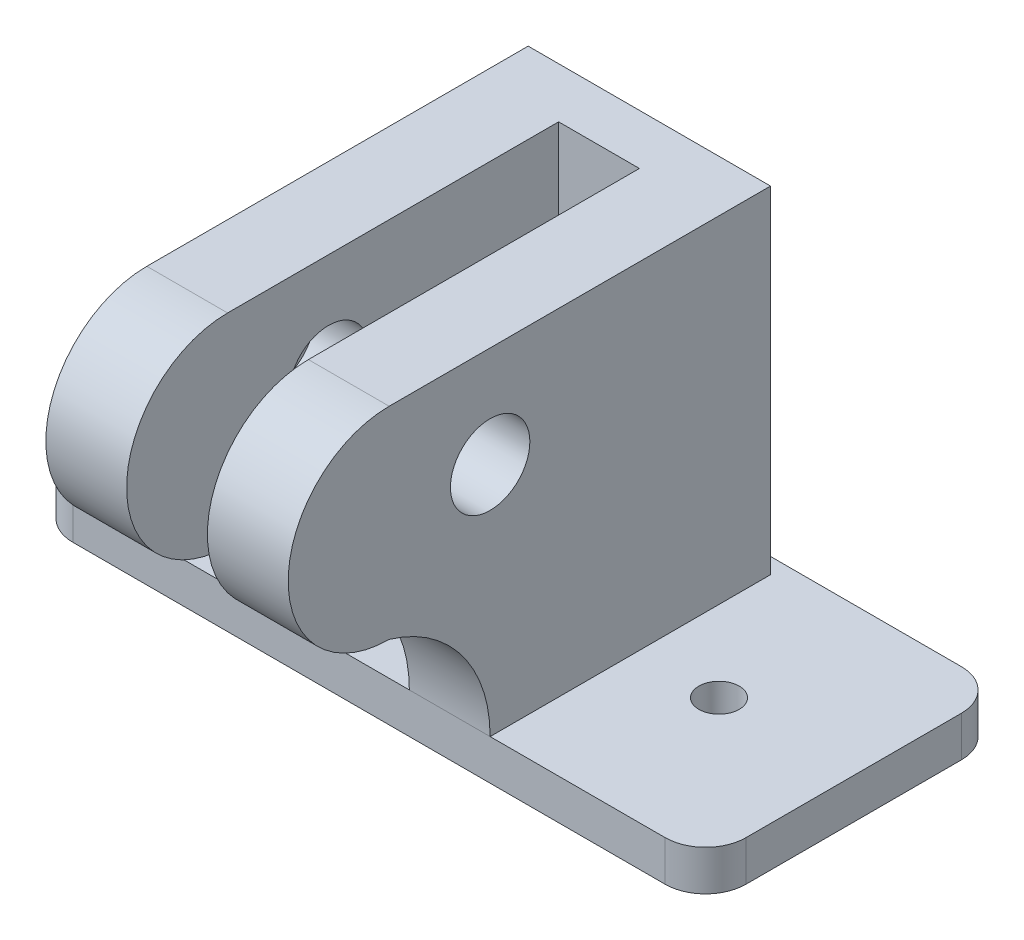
ISO-10303-21;
HEADER;
FILE_DESCRIPTION(('STEP AP214'),'2;1');
FILE_NAME('part.step','',(''),(''),'','','');
FILE_SCHEMA(('AUTOMOTIVE_DESIGN { 1 0 10303 214 1 1 1 1 }'));
ENDSEC;
DATA;
#1=APPLICATION_CONTEXT('core data for automotive mechanical design processes');
#2=APPLICATION_PROTOCOL_DEFINITION('international standard','automotive_design',2000,#1);
#3=PRODUCT_CONTEXT('',#1,'mechanical');
#4=PRODUCT('Part','Part','',(#3));
#5=PRODUCT_RELATED_PRODUCT_CATEGORY('part','',(#4));
#6=PRODUCT_DEFINITION_FORMATION('','',#4);
#7=PRODUCT_DEFINITION_CONTEXT('part definition',#1,'design');
#8=PRODUCT_DEFINITION('design','',#6,#7);
#9=PRODUCT_DEFINITION_SHAPE('','',#8);
#10=(LENGTH_UNIT() NAMED_UNIT(*) SI_UNIT(.MILLI.,.METRE.));
#11=(NAMED_UNIT(*) PLANE_ANGLE_UNIT() SI_UNIT($,.RADIAN.));
#12=(NAMED_UNIT(*) SI_UNIT($,.STERADIAN.) SOLID_ANGLE_UNIT());
#13=UNCERTAINTY_MEASURE_WITH_UNIT(LENGTH_MEASURE(1.E-05),#10,'distance_accuracy_value','');
#14=(GEOMETRIC_REPRESENTATION_CONTEXT(3) GLOBAL_UNCERTAINTY_ASSIGNED_CONTEXT((#13)) GLOBAL_UNIT_ASSIGNED_CONTEXT((#10,
#11,#12)) REPRESENTATION_CONTEXT('',''));
#15=CARTESIAN_POINT('',(0.,0.,0.));
#16=DIRECTION('',(0.,0.,1.));
#17=DIRECTION('',(1.,0.,0.));
#18=AXIS2_PLACEMENT_3D('',#15,#16,#17);
#19=CARTESIAN_POINT('',(-9.,20.5,11.));
#20=DIRECTION('',(1.,0.,0.));
#21=DIRECTION('',(0.,0.,-1.));
#22=AXIS2_PLACEMENT_3D('',#19,#20,#21);
#23=CYLINDRICAL_SURFACE('',#22,1.45);
#24=CARTESIAN_POINT('',(-9.,20.5,11.));
#25=DIRECTION('',(1.,0.,0.));
#26=DIRECTION('',(0.,0.,-1.));
#27=AXIS2_PLACEMENT_3D('',#24,#25,#26);
#28=CIRCLE('',#27,1.45);
#29=CARTESIAN_POINT('',(-9.,20.5,9.55));
#30=VERTEX_POINT('',#29);
#31=EDGE_CURVE('E315',#30,#30,#28,.T.);
#32=ORIENTED_EDGE('',*,*,#31,.F.);
#33=EDGE_LOOP('',(#32));
#34=FACE_BOUND('',#33,.T.);
#35=CARTESIAN_POINT('',(-7.,20.5,11.));
#36=DIRECTION('',(1.,0.,0.));
#37=DIRECTION('',(0.,0.,-1.));
#38=AXIS2_PLACEMENT_3D('',#35,#36,#37);
#39=CIRCLE('',#38,1.45);
#40=CARTESIAN_POINT('',(-7.,20.5,9.55));
#41=VERTEX_POINT('',#40);
#42=EDGE_CURVE('E256',#41,#41,#39,.F.);
#43=ORIENTED_EDGE('',*,*,#42,.F.);
#44=EDGE_LOOP('',(#43));
#45=FACE_BOUND('',#44,.T.);
#46=ADVANCED_FACE('F40',(#34,#45),#23,.F.);
#47=CARTESIAN_POINT('',(3.,28.,9.14820737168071));
#48=DIRECTION('',(1.,0.,0.));
#49=DIRECTION('',(0.,0.,-1.));
#50=AXIS2_PLACEMENT_3D('',#47,#48,#49);
#51=PLANE('',#50);
#52=CARTESIAN_POINT('',(3.,20.5,11.));
#53=DIRECTION('',(1.,0.,0.));
#54=DIRECTION('',(0.,0.,-1.));
#55=AXIS2_PLACEMENT_3D('',#52,#53,#54);
#56=CIRCLE('',#55,2.95);
#57=CARTESIAN_POINT('',(3.,20.5,8.05));
#58=VERTEX_POINT('',#57);
#59=EDGE_CURVE('E263',#58,#58,#56,.T.);
#60=ORIENTED_EDGE('',*,*,#59,.T.);
#61=EDGE_LOOP('',(#60));
#62=FACE_BOUND('',#61,.T.);
#63=CARTESIAN_POINT('',(3.,20.5,18.5));
#64=DIRECTION('',(1.,0.,0.));
#65=DIRECTION('',(0.,0.,-1.));
#66=AXIS2_PLACEMENT_3D('',#63,#64,#65);
#67=CIRCLE('',#66,7.5);
#68=CARTESIAN_POINT('',(3.,28.,18.5));
#69=VERTEX_POINT('',#68);
#70=CARTESIAN_POINT('',(3.,13.,18.5));
#71=VERTEX_POINT('',#70);
#72=EDGE_CURVE('E327',#69,#71,#67,.T.);
#73=ORIENTED_EDGE('',*,*,#72,.F.);
#74=DIRECTION('',(0.,0.,1.));
#75=VECTOR('',#74,1.);
#76=CARTESIAN_POINT('',(3.,28.,-6.08635992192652));
#77=LINE('',#76,#75);
#78=CARTESIAN_POINT('',(3.,28.,-6.08635992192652));
#79=VERTEX_POINT('',#78);
#80=EDGE_CURVE('E339',#79,#69,#77,.T.);
#81=ORIENTED_EDGE('',*,*,#80,.F.);
#82=DIRECTION('',(0.,-1.,0.));
#83=VECTOR('',#82,1.);
#84=CARTESIAN_POINT('',(3.,28.,-6.08635992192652));
#85=LINE('',#84,#83);
#86=CARTESIAN_POINT('',(3.,3.,-6.08635992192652));
#87=VERTEX_POINT('',#86);
#88=EDGE_CURVE('E230',#79,#87,#85,.T.);
#89=ORIENTED_EDGE('',*,*,#88,.T.);
#90=DIRECTION('',(0.,0.,1.));
#91=VECTOR('',#90,1.);
#92=CARTESIAN_POINT('',(3.,3.,9.14820737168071));
#93=LINE('',#92,#91);
#94=CARTESIAN_POINT('',(3.,3.,11.));
#95=VERTEX_POINT('',#94);
#96=EDGE_CURVE('E207',#87,#95,#93,.T.);
#97=ORIENTED_EDGE('',*,*,#96,.T.);
#98=CARTESIAN_POINT('',(3.00000000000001,3.,21.4166666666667));
#99=DIRECTION('',(1.,0.,0.));
#100=DIRECTION('',(0.,0.,-1.));
#101=AXIS2_PLACEMENT_3D('',#98,#99,#100);
#102=CIRCLE('',#101,10.4166666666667);
#103=EDGE_CURVE('E332',#95,#71,#102,.T.);
#104=ORIENTED_EDGE('',*,*,#103,.T.);
#105=EDGE_LOOP('',(#73,#81,#89,#97,#104));
#106=FACE_BOUND('',#105,.T.);
#107=ADVANCED_FACE('F374',(#62,#106),#51,.F.);
#108=CARTESIAN_POINT('',(9.,28.,9.14820737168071));
#109=DIRECTION('',(-1.,0.,0.));
#110=DIRECTION('',(0.,0.,1.));
#111=AXIS2_PLACEMENT_3D('',#108,#109,#110);
#112=PLANE('',#111);
#113=CARTESIAN_POINT('',(9.,20.5,11.));
#114=DIRECTION('',(1.,0.,0.));
#115=DIRECTION('',(0.,0.,-1.));
#116=AXIS2_PLACEMENT_3D('',#113,#114,#115);
#117=CIRCLE('',#116,2.95);
#118=CARTESIAN_POINT('',(9.,20.5,8.05));
#119=VERTEX_POINT('',#118);
#120=EDGE_CURVE('E300',#119,#119,#117,.T.);
#121=ORIENTED_EDGE('',*,*,#120,.F.);
#122=EDGE_LOOP('',(#121));
#123=FACE_BOUND('',#122,.T.);
#124=DIRECTION('',(0.,0.,-1.));
#125=VECTOR('',#124,1.);
#126=CARTESIAN_POINT('',(9.00000000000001,28.,11.));
#127=LINE('',#126,#125);
#128=CARTESIAN_POINT('',(9.,28.,18.5));
#129=VERTEX_POINT('',#128);
#130=CARTESIAN_POINT('',(9.,28.,-9.82490404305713));
#131=VERTEX_POINT('',#130);
#132=EDGE_CURVE('E200',#129,#131,#127,.T.);
#133=ORIENTED_EDGE('',*,*,#132,.F.);
#134=CARTESIAN_POINT('',(9.,20.5,18.5));
#135=DIRECTION('',(1.,0.,0.));
#136=DIRECTION('',(0.,0.,-1.));
#137=AXIS2_PLACEMENT_3D('',#134,#135,#136);
#138=CIRCLE('',#137,7.5);
#139=CARTESIAN_POINT('',(9.,13.,18.5));
#140=VERTEX_POINT('',#139);
#141=EDGE_CURVE('E318',#129,#140,#138,.T.);
#142=ORIENTED_EDGE('',*,*,#141,.T.);
#143=CARTESIAN_POINT('',(9.,3.,21.4166666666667));
#144=DIRECTION('',(1.,0.,0.));
#145=DIRECTION('',(0.,0.,-1.));
#146=AXIS2_PLACEMENT_3D('',#143,#144,#145);
#147=CIRCLE('',#146,10.4166666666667);
#148=CARTESIAN_POINT('',(9.,3.,11.));
#149=VERTEX_POINT('',#148);
#150=EDGE_CURVE('E189',#149,#140,#147,.T.);
#151=ORIENTED_EDGE('',*,*,#150,.F.);
#152=DIRECTION('',(0.,0.,-1.));
#153=VECTOR('',#152,1.);
#154=CARTESIAN_POINT('',(9.,3.,9.14820737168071));
#155=LINE('',#154,#153);
#156=CARTESIAN_POINT('',(9.,3.,-9.82490404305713));
#157=VERTEX_POINT('',#156);
#158=EDGE_CURVE('E211',#149,#157,#155,.T.);
#159=ORIENTED_EDGE('',*,*,#158,.T.);
#160=DIRECTION('',(0.,-1.,0.));
#161=VECTOR('',#160,1.);
#162=CARTESIAN_POINT('',(9.,28.,-9.82490404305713));
#163=LINE('',#162,#161);
#164=EDGE_CURVE('E227',#131,#157,#163,.T.);
#165=ORIENTED_EDGE('',*,*,#164,.F.);
#166=EDGE_LOOP('',(#133,#142,#151,#159,#165));
#167=FACE_BOUND('',#166,.T.);
#168=ADVANCED_FACE('F346',(#123,#167),#112,.F.);
#169=CARTESIAN_POINT('',(-9.,28.,9.14820737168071));
#170=DIRECTION('',(1.,0.,0.));
#171=DIRECTION('',(0.,0.,-1.));
#172=AXIS2_PLACEMENT_3D('',#169,#170,#171);
#173=PLANE('',#172);
#174=ORIENTED_EDGE('',*,*,#31,.T.);
#175=EDGE_LOOP('',(#174));
#176=FACE_BOUND('',#175,.T.);
#177=CARTESIAN_POINT('',(-9.,20.5,18.5));
#178=DIRECTION('',(1.,0.,0.));
#179=DIRECTION('',(0.,0.,-1.));
#180=AXIS2_PLACEMENT_3D('',#177,#178,#179);
#181=CIRCLE('',#180,7.5);
#182=CARTESIAN_POINT('',(-9.,28.,18.5));
#183=VERTEX_POINT('',#182);
#184=CARTESIAN_POINT('',(-9.,13.,18.5));
#185=VERTEX_POINT('',#184);
#186=EDGE_CURVE('E168',#183,#185,#181,.T.);
#187=ORIENTED_EDGE('',*,*,#186,.F.);
#188=DIRECTION('',(0.,0.,1.));
#189=VECTOR('',#188,1.);
#190=CARTESIAN_POINT('',(-9.,28.,-9.82490404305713));
#191=LINE('',#190,#189);
#192=CARTESIAN_POINT('',(-9.,28.,-9.82490404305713));
#193=VERTEX_POINT('',#192);
#194=EDGE_CURVE('E173',#193,#183,#191,.T.);
#195=ORIENTED_EDGE('',*,*,#194,.F.);
#196=DIRECTION('',(0.,-1.,0.));
#197=VECTOR('',#196,1.);
#198=CARTESIAN_POINT('',(-9.,28.,-9.82490404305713));
#199=LINE('',#198,#197);
#200=CARTESIAN_POINT('',(-9.,3.,-9.82490404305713));
#201=VERTEX_POINT('',#200);
#202=EDGE_CURVE('E225',#193,#201,#199,.T.);
#203=ORIENTED_EDGE('',*,*,#202,.T.);
#204=DIRECTION('',(0.,0.,1.));
#205=VECTOR('',#204,1.);
#206=CARTESIAN_POINT('',(-9.,3.,9.14820737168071));
#207=LINE('',#206,#205);
#208=CARTESIAN_POINT('',(-9.,3.,11.));
#209=VERTEX_POINT('',#208);
#210=EDGE_CURVE('E217',#201,#209,#207,.T.);
#211=ORIENTED_EDGE('',*,*,#210,.T.);
#212=CARTESIAN_POINT('',(-9.,3.,21.4166666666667));
#213=DIRECTION('',(1.,0.,0.));
#214=DIRECTION('',(0.,0.,-1.));
#215=AXIS2_PLACEMENT_3D('',#212,#213,#214);
#216=CIRCLE('',#215,10.4166666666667);
#217=EDGE_CURVE('E176',#209,#185,#216,.T.);
#218=ORIENTED_EDGE('',*,*,#217,.T.);
#219=EDGE_LOOP('',(#187,#195,#203,#211,#218));
#220=FACE_BOUND('',#219,.T.);
#221=ADVANCED_FACE('F170',(#176,#220),#173,.F.);
#222=CARTESIAN_POINT('',(-3.,28.,9.14820737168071));
#223=DIRECTION('',(-1.,0.,0.));
#224=DIRECTION('',(0.,0.,1.));
#225=AXIS2_PLACEMENT_3D('',#222,#223,#224);
#226=PLANE('',#225);
#227=CARTESIAN_POINT('',(-3.,20.5,11.));
#228=DIRECTION('',(-1.,0.,0.));
#229=DIRECTION('',(0.,0.,1.));
#230=AXIS2_PLACEMENT_3D('',#227,#228,#229);
#231=CIRCLE('',#230,2.95);
#232=CARTESIAN_POINT('',(-3.,20.5,13.95));
#233=VERTEX_POINT('',#232);
#234=EDGE_CURVE('E259',#233,#233,#231,.T.);
#235=ORIENTED_EDGE('',*,*,#234,.T.);
#236=EDGE_LOOP('',(#235));
#237=FACE_BOUND('',#236,.T.);
#238=DIRECTION('',(0.,0.,-1.));
#239=VECTOR('',#238,1.);
#240=CARTESIAN_POINT('',(-3.,28.,11.));
#241=LINE('',#240,#239);
#242=CARTESIAN_POINT('',(-3.,28.,18.5));
#243=VERTEX_POINT('',#242);
#244=CARTESIAN_POINT('',(-3.,28.,-6.08635992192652));
#245=VERTEX_POINT('',#244);
#246=EDGE_CURVE('E196',#243,#245,#241,.T.);
#247=ORIENTED_EDGE('',*,*,#246,.F.);
#248=CARTESIAN_POINT('',(-3.,20.5,18.5));
#249=DIRECTION('',(-1.,0.,0.));
#250=DIRECTION('',(0.,0.,1.));
#251=AXIS2_PLACEMENT_3D('',#248,#249,#250);
#252=CIRCLE('',#251,7.5);
#253=CARTESIAN_POINT('',(-3.,13.,18.5));
#254=VERTEX_POINT('',#253);
#255=EDGE_CURVE('E186',#254,#243,#252,.T.);
#256=ORIENTED_EDGE('',*,*,#255,.F.);
#257=CARTESIAN_POINT('',(-3.,3.,21.4166666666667));
#258=DIRECTION('',(-1.,0.,0.));
#259=DIRECTION('',(0.,0.,1.));
#260=AXIS2_PLACEMENT_3D('',#257,#258,#259);
#261=CIRCLE('',#260,10.4166666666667);
#262=CARTESIAN_POINT('',(-3.,3.,11.));
#263=VERTEX_POINT('',#262);
#264=EDGE_CURVE('E329',#254,#263,#261,.T.);
#265=ORIENTED_EDGE('',*,*,#264,.T.);
#266=DIRECTION('',(0.,0.,-1.));
#267=VECTOR('',#266,1.);
#268=CARTESIAN_POINT('',(-3.,3.,9.14820737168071));
#269=LINE('',#268,#267);
#270=CARTESIAN_POINT('',(-3.,3.,-6.08635992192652));
#271=VERTEX_POINT('',#270);
#272=EDGE_CURVE('E219',#263,#271,#269,.T.);
#273=ORIENTED_EDGE('',*,*,#272,.T.);
#274=DIRECTION('',(0.,-1.,0.));
#275=VECTOR('',#274,1.);
#276=CARTESIAN_POINT('',(-3.,28.,-6.08635992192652));
#277=LINE('',#276,#275);
#278=EDGE_CURVE('E198',#245,#271,#277,.T.);
#279=ORIENTED_EDGE('',*,*,#278,.F.);
#280=EDGE_LOOP('',(#247,#256,#265,#273,#279));
#281=FACE_BOUND('',#280,.T.);
#282=ADVANCED_FACE('F367',(#237,#281),#226,.F.);
#283=CARTESIAN_POINT('',(-25.,3.,11.));
#284=DIRECTION('',(0.,0.,-1.));
#285=DIRECTION('',(-1.,0.,0.));
#286=AXIS2_PLACEMENT_3D('',#283,#284,#285);
#287=PLANE('',#286);
#288=DIRECTION('',(1.,0.,0.));
#289=VECTOR('',#288,1.);
#290=CARTESIAN_POINT('',(-25.,3.,11.));
#291=LINE('',#290,#289);
#292=CARTESIAN_POINT('',(-22.,3.,11.));
#293=VERTEX_POINT('',#292);
#294=EDGE_CURVE('E243',#293,#209,#291,.T.);
#295=ORIENTED_EDGE('',*,*,#294,.F.);
#296=DIRECTION('',(0.,-1.,0.));
#297=VECTOR('',#296,1.);
#298=CARTESIAN_POINT('',(-22.,3.,11.));
#299=LINE('',#298,#297);
#300=CARTESIAN_POINT('',(-22.,0.,11.));
#301=VERTEX_POINT('',#300);
#302=EDGE_CURVE('E290',#293,#301,#299,.T.);
#303=ORIENTED_EDGE('',*,*,#302,.T.);
#304=DIRECTION('',(1.,0.,0.));
#305=VECTOR('',#304,1.);
#306=CARTESIAN_POINT('',(-25.,0.,11.));
#307=LINE('',#306,#305);
#308=CARTESIAN_POINT('',(22.,0.,11.));
#309=VERTEX_POINT('',#308);
#310=EDGE_CURVE('E237',#301,#309,#307,.T.);
#311=ORIENTED_EDGE('',*,*,#310,.T.);
#312=DIRECTION('',(0.,-1.,0.));
#313=VECTOR('',#312,1.);
#314=CARTESIAN_POINT('',(22.,3.,11.));
#315=LINE('',#314,#313);
#316=CARTESIAN_POINT('',(22.,3.,11.));
#317=VERTEX_POINT('',#316);
#318=EDGE_CURVE('E288',#309,#317,#315,.F.);
#319=ORIENTED_EDGE('',*,*,#318,.T.);
#320=EDGE_CURVE('E242',#149,#317,#291,.T.);
#321=ORIENTED_EDGE('',*,*,#320,.F.);
#322=DIRECTION('',(1.,0.,0.));
#323=VECTOR('',#322,1.);
#324=CARTESIAN_POINT('',(3.,3.,11.));
#325=LINE('',#324,#323);
#326=EDGE_CURVE('E335',#95,#149,#325,.T.);
#327=ORIENTED_EDGE('',*,*,#326,.F.);
#328=EDGE_CURVE('E246',#263,#95,#291,.T.);
#329=ORIENTED_EDGE('',*,*,#328,.F.);
#330=DIRECTION('',(1.,0.,0.));
#331=VECTOR('',#330,1.);
#332=CARTESIAN_POINT('',(-3.,3.,11.));
#333=LINE('',#332,#331);
#334=EDGE_CURVE('E208',#209,#263,#333,.T.);
#335=ORIENTED_EDGE('',*,*,#334,.F.);
#336=EDGE_LOOP('',(#295,#303,#311,#319,#321,#327,#329,#335));
#337=FACE_BOUND('',#336,.T.);
#338=ADVANCED_FACE('F358',(#337),#287,.F.);
#339=CARTESIAN_POINT('',(0.,3.,0.));
#340=DIRECTION('',(0.,1.,0.));
#341=DIRECTION('',(0.,0.,1.));
#342=AXIS2_PLACEMENT_3D('',#339,#340,#341);
#343=PLANE('',#342);
#344=CARTESIAN_POINT('',(-15.,3.,0.));
#345=DIRECTION('',(0.,1.,0.));
#346=DIRECTION('',(0.,0.,1.));
#347=AXIS2_PLACEMENT_3D('',#344,#345,#346);
#348=CIRCLE('',#347,1.5);
#349=CARTESIAN_POINT('',(-15.,3.,1.5));
#350=VERTEX_POINT('',#349);
#351=EDGE_CURVE('E296',#350,#350,#348,.T.);
#352=ORIENTED_EDGE('',*,*,#351,.F.);
#353=EDGE_LOOP('',(#352));
#354=FACE_BOUND('',#353,.T.);
#355=CARTESIAN_POINT('',(15.,3.,0.));
#356=DIRECTION('',(0.,1.,0.));
#357=DIRECTION('',(0.,0.,-1.));
#358=AXIS2_PLACEMENT_3D('',#355,#356,#357);
#359=CIRCLE('',#358,1.5);
#360=CARTESIAN_POINT('',(15.,3.,-1.5));
#361=VERTEX_POINT('',#360);
#362=EDGE_CURVE('E302',#361,#361,#359,.T.);
#363=ORIENTED_EDGE('',*,*,#362,.F.);
#364=EDGE_LOOP('',(#363));
#365=FACE_BOUND('',#364,.T.);
#366=DIRECTION('',(-1.,0.,0.));
#367=VECTOR('',#366,1.);
#368=CARTESIAN_POINT('',(-25.,3.,-11.));
#369=LINE('',#368,#367);
#370=CARTESIAN_POINT('',(22.,3.,-11.));
#371=VERTEX_POINT('',#370);
#372=CARTESIAN_POINT('',(-22.,3.,-11.));
#373=VERTEX_POINT('',#372);
#374=EDGE_CURVE('E236',#371,#373,#369,.T.);
#375=ORIENTED_EDGE('',*,*,#374,.T.);
#376=CARTESIAN_POINT('',(-22.,3.,-8.));
#377=DIRECTION('',(0.,1.,0.));
#378=DIRECTION('',(0.,0.,1.));
#379=AXIS2_PLACEMENT_3D('',#376,#377,#378);
#380=CIRCLE('',#379,3.);
#381=CARTESIAN_POINT('',(-25.,3.,-8.));
#382=VERTEX_POINT('',#381);
#383=EDGE_CURVE('E286',#373,#382,#380,.T.);
#384=ORIENTED_EDGE('',*,*,#383,.T.);
#385=DIRECTION('',(0.,0.,1.));
#386=VECTOR('',#385,1.);
#387=CARTESIAN_POINT('',(-25.,3.,-11.));
#388=LINE('',#387,#386);
#389=CARTESIAN_POINT('',(-25.,3.,8.));
#390=VERTEX_POINT('',#389);
#391=EDGE_CURVE('E240',#382,#390,#388,.T.);
#392=ORIENTED_EDGE('',*,*,#391,.T.);
#393=CARTESIAN_POINT('',(-22.,3.,8.));
#394=DIRECTION('',(0.,1.,0.));
#395=DIRECTION('',(0.,0.,1.));
#396=AXIS2_PLACEMENT_3D('',#393,#394,#395);
#397=CIRCLE('',#396,3.);
#398=EDGE_CURVE('E57',#390,#293,#397,.T.);
#399=ORIENTED_EDGE('',*,*,#398,.T.);
#400=ORIENTED_EDGE('',*,*,#294,.T.);
#401=ORIENTED_EDGE('',*,*,#210,.F.);
#402=DIRECTION('',(-1.,0.,0.));
#403=VECTOR('',#402,1.);
#404=CARTESIAN_POINT('',(9.,3.,-9.82490404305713));
#405=LINE('',#404,#403);
#406=EDGE_CURVE('E214',#157,#201,#405,.T.);
#407=ORIENTED_EDGE('',*,*,#406,.F.);
#408=ORIENTED_EDGE('',*,*,#158,.F.);
#409=ORIENTED_EDGE('',*,*,#320,.T.);
#410=CARTESIAN_POINT('',(22.,3.,8.));
#411=DIRECTION('',(0.,1.,0.));
#412=DIRECTION('',(0.,0.,1.));
#413=AXIS2_PLACEMENT_3D('',#410,#411,#412);
#414=CIRCLE('',#413,3.);
#415=CARTESIAN_POINT('',(25.,3.,8.));
#416=VERTEX_POINT('',#415);
#417=EDGE_CURVE('E281',#317,#416,#414,.T.);
#418=ORIENTED_EDGE('',*,*,#417,.T.);
#419=DIRECTION('',(0.,0.,-1.));
#420=VECTOR('',#419,1.);
#421=CARTESIAN_POINT('',(25.,3.,-11.));
#422=LINE('',#421,#420);
#423=CARTESIAN_POINT('',(25.,3.,-8.));
#424=VERTEX_POINT('',#423);
#425=EDGE_CURVE('E234',#416,#424,#422,.T.);
#426=ORIENTED_EDGE('',*,*,#425,.T.);
#427=CARTESIAN_POINT('',(22.,3.,-8.));
#428=DIRECTION('',(0.,1.,0.));
#429=DIRECTION('',(0.,0.,1.));
#430=AXIS2_PLACEMENT_3D('',#427,#428,#429);
#431=CIRCLE('',#430,3.);
#432=EDGE_CURVE('E283',#424,#371,#431,.T.);
#433=ORIENTED_EDGE('',*,*,#432,.T.);
#434=EDGE_LOOP('',(#375,#384,#392,#399,#400,#401,#407,#408,#409,#418,#426,#433));
#435=FACE_BOUND('',#434,.T.);
#436=ADVANCED_FACE('F351',(#354,#365,#435),#343,.T.);
#437=CARTESIAN_POINT('',(25.,3.,-11.));
#438=DIRECTION('',(-1.,0.,0.));
#439=DIRECTION('',(0.,0.,1.));
#440=AXIS2_PLACEMENT_3D('',#437,#438,#439);
#441=PLANE('',#440);
#442=DIRECTION('',(0.,0.,-1.));
#443=VECTOR('',#442,1.);
#444=CARTESIAN_POINT('',(25.,0.,-11.));
#445=LINE('',#444,#443);
#446=CARTESIAN_POINT('',(25.,0.,8.));
#447=VERTEX_POINT('',#446);
#448=CARTESIAN_POINT('',(25.,0.,-8.));
#449=VERTEX_POINT('',#448);
#450=EDGE_CURVE('E233',#447,#449,#445,.T.);
#451=ORIENTED_EDGE('',*,*,#450,.T.);
#452=DIRECTION('',(0.,-1.,0.));
#453=VECTOR('',#452,1.);
#454=CARTESIAN_POINT('',(25.,3.,-8.));
#455=LINE('',#454,#453);
#456=EDGE_CURVE('E11',#449,#424,#455,.F.);
#457=ORIENTED_EDGE('',*,*,#456,.T.);
#458=ORIENTED_EDGE('',*,*,#425,.F.);
#459=DIRECTION('',(0.,-1.,0.));
#460=VECTOR('',#459,1.);
#461=CARTESIAN_POINT('',(25.,3.,8.));
#462=LINE('',#461,#460);
#463=EDGE_CURVE('E49',#416,#447,#462,.T.);
#464=ORIENTED_EDGE('',*,*,#463,.T.);
#465=EDGE_LOOP('',(#451,#457,#458,#464));
#466=FACE_BOUND('',#465,.T.);
#467=ADVANCED_FACE('F386',(#466),#441,.F.);
#468=CARTESIAN_POINT('',(-25.,3.,-11.));
#469=DIRECTION('',(0.,0.,1.));
#470=DIRECTION('',(1.,0.,0.));
#471=AXIS2_PLACEMENT_3D('',#468,#469,#470);
#472=PLANE('',#471);
#473=DIRECTION('',(-1.,0.,0.));
#474=VECTOR('',#473,1.);
#475=CARTESIAN_POINT('',(-25.,0.,-11.));
#476=LINE('',#475,#474);
#477=CARTESIAN_POINT('',(22.,0.,-11.));
#478=VERTEX_POINT('',#477);
#479=CARTESIAN_POINT('',(-22.,0.,-11.));
#480=VERTEX_POINT('',#479);
#481=EDGE_CURVE('E248',#478,#480,#476,.T.);
#482=ORIENTED_EDGE('',*,*,#481,.T.);
#483=DIRECTION('',(0.,-1.,0.));
#484=VECTOR('',#483,1.);
#485=CARTESIAN_POINT('',(-22.,3.,-11.));
#486=LINE('',#485,#484);
#487=EDGE_CURVE('E279',#480,#373,#486,.F.);
#488=ORIENTED_EDGE('',*,*,#487,.T.);
#489=ORIENTED_EDGE('',*,*,#374,.F.);
#490=DIRECTION('',(0.,-1.,0.));
#491=VECTOR('',#490,1.);
#492=CARTESIAN_POINT('',(22.,3.,-11.));
#493=LINE('',#492,#491);
#494=EDGE_CURVE('E276',#371,#478,#493,.T.);
#495=ORIENTED_EDGE('',*,*,#494,.T.);
#496=EDGE_LOOP('',(#482,#488,#489,#495));
#497=FACE_BOUND('',#496,.T.);
#498=ADVANCED_FACE('F397',(#497),#472,.F.);
#499=CARTESIAN_POINT('',(-25.,3.,-11.));
#500=DIRECTION('',(1.,0.,0.));
#501=DIRECTION('',(0.,0.,-1.));
#502=AXIS2_PLACEMENT_3D('',#499,#500,#501);
#503=PLANE('',#502);
#504=ORIENTED_EDGE('',*,*,#391,.F.);
#505=DIRECTION('',(0.,-1.,0.));
#506=VECTOR('',#505,1.);
#507=CARTESIAN_POINT('',(-25.,3.,-8.));
#508=LINE('',#507,#506);
#509=CARTESIAN_POINT('',(-25.,0.,-8.));
#510=VERTEX_POINT('',#509);
#511=EDGE_CURVE('E265',#382,#510,#508,.T.);
#512=ORIENTED_EDGE('',*,*,#511,.T.);
#513=DIRECTION('',(0.,0.,1.));
#514=VECTOR('',#513,1.);
#515=CARTESIAN_POINT('',(-25.,0.,-11.));
#516=LINE('',#515,#514);
#517=CARTESIAN_POINT('',(-25.,0.,8.));
#518=VERTEX_POINT('',#517);
#519=EDGE_CURVE('E251',#510,#518,#516,.T.);
#520=ORIENTED_EDGE('',*,*,#519,.T.);
#521=DIRECTION('',(0.,-1.,0.));
#522=VECTOR('',#521,1.);
#523=CARTESIAN_POINT('',(-25.,3.,8.));
#524=LINE('',#523,#522);
#525=EDGE_CURVE('E245',#518,#390,#524,.F.);
#526=ORIENTED_EDGE('',*,*,#525,.T.);
#527=EDGE_LOOP('',(#504,#512,#520,#526));
#528=FACE_BOUND('',#527,.T.);
#529=ADVANCED_FACE('F405',(#528),#503,.F.);
#530=ORIENTED_EDGE('',*,*,#272,.F.);
#531=ORIENTED_EDGE('',*,*,#328,.T.);
#532=ORIENTED_EDGE('',*,*,#96,.F.);
#533=DIRECTION('',(1.,0.,0.));
#534=VECTOR('',#533,1.);
#535=CARTESIAN_POINT('',(0.,3.,-6.08635992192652));
#536=LINE('',#535,#534);
#537=EDGE_CURVE('E204',#271,#87,#536,.T.);
#538=ORIENTED_EDGE('',*,*,#537,.F.);
#539=EDGE_LOOP('',(#530,#531,#532,#538));
#540=FACE_BOUND('',#539,.T.);
#541=ADVANCED_FACE('F364',(#540),#343,.T.);
#542=CARTESIAN_POINT('',(0.,0.,0.));
#543=DIRECTION('',(0.,1.,0.));
#544=DIRECTION('',(0.,0.,1.));
#545=AXIS2_PLACEMENT_3D('',#542,#543,#544);
#546=PLANE('',#545);
#547=CARTESIAN_POINT('',(-15.,0.,0.));
#548=DIRECTION('',(0.,1.,0.));
#549=DIRECTION('',(0.,0.,1.));
#550=AXIS2_PLACEMENT_3D('',#547,#548,#549);
#551=CIRCLE('',#550,1.5);
#552=CARTESIAN_POINT('',(-15.,0.,1.5));
#553=VERTEX_POINT('',#552);
#554=EDGE_CURVE('E44',#553,#553,#551,.T.);
#555=ORIENTED_EDGE('',*,*,#554,.T.);
#556=EDGE_LOOP('',(#555));
#557=FACE_BOUND('',#556,.T.);
#558=CARTESIAN_POINT('',(15.,0.,0.));
#559=DIRECTION('',(0.,1.,0.));
#560=DIRECTION('',(0.,0.,1.));
#561=AXIS2_PLACEMENT_3D('',#558,#559,#560);
#562=CIRCLE('',#561,1.5);
#563=CARTESIAN_POINT('',(15.,0.,1.49999999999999));
#564=VERTEX_POINT('',#563);
#565=EDGE_CURVE('E294',#564,#564,#562,.T.);
#566=ORIENTED_EDGE('',*,*,#565,.T.);
#567=EDGE_LOOP('',(#566));
#568=FACE_BOUND('',#567,.T.);
#569=ORIENTED_EDGE('',*,*,#519,.F.);
#570=CARTESIAN_POINT('',(-22.,0.,-8.));
#571=DIRECTION('',(0.,1.,0.));
#572=DIRECTION('',(0.,0.,1.));
#573=AXIS2_PLACEMENT_3D('',#570,#571,#572);
#574=CIRCLE('',#573,3.);
#575=EDGE_CURVE('E274',#510,#480,#574,.F.);
#576=ORIENTED_EDGE('',*,*,#575,.T.);
#577=ORIENTED_EDGE('',*,*,#481,.F.);
#578=CARTESIAN_POINT('',(22.,0.,-8.));
#579=DIRECTION('',(0.,1.,0.));
#580=DIRECTION('',(0.,0.,1.));
#581=AXIS2_PLACEMENT_3D('',#578,#579,#580);
#582=CIRCLE('',#581,3.);
#583=EDGE_CURVE('E270',#478,#449,#582,.F.);
#584=ORIENTED_EDGE('',*,*,#583,.T.);
#585=ORIENTED_EDGE('',*,*,#450,.F.);
#586=CARTESIAN_POINT('',(22.,0.,8.));
#587=DIRECTION('',(0.,1.,0.));
#588=DIRECTION('',(0.,0.,1.));
#589=AXIS2_PLACEMENT_3D('',#586,#587,#588);
#590=CIRCLE('',#589,3.);
#591=EDGE_CURVE('E268',#447,#309,#590,.F.);
#592=ORIENTED_EDGE('',*,*,#591,.T.);
#593=ORIENTED_EDGE('',*,*,#310,.F.);
#594=CARTESIAN_POINT('',(-22.,0.,8.));
#595=DIRECTION('',(0.,1.,0.));
#596=DIRECTION('',(0.,0.,1.));
#597=AXIS2_PLACEMENT_3D('',#594,#595,#596);
#598=CIRCLE('',#597,3.);
#599=EDGE_CURVE('E272',#301,#518,#598,.F.);
#600=ORIENTED_EDGE('',*,*,#599,.T.);
#601=EDGE_LOOP('',(#569,#576,#577,#584,#585,#592,#593,#600));
#602=FACE_BOUND('',#601,.T.);
#603=ADVANCED_FACE('F390',(#557,#568,#602),#546,.F.);
#604=CARTESIAN_POINT('',(0.,28.,-6.08635992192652));
#605=DIRECTION('',(0.,0.,-1.));
#606=DIRECTION('',(-1.,0.,0.));
#607=AXIS2_PLACEMENT_3D('',#604,#605,#606);
#608=PLANE('',#607);
#609=ORIENTED_EDGE('',*,*,#537,.T.);
#610=ORIENTED_EDGE('',*,*,#88,.F.);
#611=DIRECTION('',(1.,0.,0.));
#612=VECTOR('',#611,1.);
#613=CARTESIAN_POINT('',(-3.,28.,-6.08635992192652));
#614=LINE('',#613,#612);
#615=EDGE_CURVE('E222',#245,#79,#614,.T.);
#616=ORIENTED_EDGE('',*,*,#615,.F.);
#617=ORIENTED_EDGE('',*,*,#278,.T.);
#618=EDGE_LOOP('',(#609,#610,#616,#617));
#619=FACE_BOUND('',#618,.T.);
#620=ADVANCED_FACE('F370',(#619),#608,.F.);
#621=CARTESIAN_POINT('',(9.,28.,-9.82490404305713));
#622=DIRECTION('',(0.,0.,1.));
#623=DIRECTION('',(1.,0.,0.));
#624=AXIS2_PLACEMENT_3D('',#621,#622,#623);
#625=PLANE('',#624);
#626=ORIENTED_EDGE('',*,*,#406,.T.);
#627=ORIENTED_EDGE('',*,*,#202,.F.);
#628=DIRECTION('',(-1.,0.,0.));
#629=VECTOR('',#628,1.);
#630=CARTESIAN_POINT('',(9.,28.,-9.82490404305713));
#631=LINE('',#630,#629);
#632=EDGE_CURVE('E194',#131,#193,#631,.T.);
#633=ORIENTED_EDGE('',*,*,#632,.F.);
#634=ORIENTED_EDGE('',*,*,#164,.T.);
#635=EDGE_LOOP('',(#626,#627,#633,#634));
#636=FACE_BOUND('',#635,.T.);
#637=ADVANCED_FACE('F350',(#636),#625,.F.);
#638=CARTESIAN_POINT('',(0.,28.,0.));
#639=DIRECTION('',(0.,-1.,0.));
#640=DIRECTION('',(0.,0.,-1.));
#641=AXIS2_PLACEMENT_3D('',#638,#639,#640);
#642=PLANE('',#641);
#643=ORIENTED_EDGE('',*,*,#194,.T.);
#644=DIRECTION('',(1.,0.,0.));
#645=VECTOR('',#644,1.);
#646=CARTESIAN_POINT('',(-9.,28.,18.5));
#647=LINE('',#646,#645);
#648=EDGE_CURVE('E183',#183,#243,#647,.T.);
#649=ORIENTED_EDGE('',*,*,#648,.T.);
#650=ORIENTED_EDGE('',*,*,#246,.T.);
#651=ORIENTED_EDGE('',*,*,#615,.T.);
#652=ORIENTED_EDGE('',*,*,#80,.T.);
#653=EDGE_CURVE('E190',#69,#129,#647,.T.);
#654=ORIENTED_EDGE('',*,*,#653,.T.);
#655=ORIENTED_EDGE('',*,*,#132,.T.);
#656=ORIENTED_EDGE('',*,*,#632,.T.);
#657=EDGE_LOOP('',(#643,#649,#650,#651,#652,#654,#655,#656));
#658=FACE_BOUND('',#657,.T.);
#659=ADVANCED_FACE('F192',(#658),#642,.F.);
#660=CARTESIAN_POINT('',(-9.,20.5,18.5));
#661=DIRECTION('',(1.,0.,0.));
#662=DIRECTION('',(0.,0.,-1.));
#663=AXIS2_PLACEMENT_3D('',#660,#661,#662);
#664=CYLINDRICAL_SURFACE('',#663,7.5);
#665=ORIENTED_EDGE('',*,*,#72,.T.);
#666=DIRECTION('',(1.,0.,0.));
#667=VECTOR('',#666,1.);
#668=CARTESIAN_POINT('',(-9.,13.,18.5));
#669=LINE('',#668,#667);
#670=EDGE_CURVE('E180',#71,#140,#669,.T.);
#671=ORIENTED_EDGE('',*,*,#670,.T.);
#672=ORIENTED_EDGE('',*,*,#141,.F.);
#673=ORIENTED_EDGE('',*,*,#653,.F.);
#674=EDGE_LOOP('',(#665,#671,#672,#673));
#675=FACE_BOUND('',#674,.T.);
#676=ADVANCED_FACE('F377',(#675),#664,.T.);
#677=CARTESIAN_POINT('',(-9.,3.,21.4166666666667));
#678=DIRECTION('',(1.,0.,0.));
#679=DIRECTION('',(0.,0.,-1.));
#680=AXIS2_PLACEMENT_3D('',#677,#678,#679);
#681=CYLINDRICAL_SURFACE('',#680,10.4166666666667);
#682=ORIENTED_EDGE('',*,*,#326,.T.);
#683=ORIENTED_EDGE('',*,*,#150,.T.);
#684=ORIENTED_EDGE('',*,*,#670,.F.);
#685=ORIENTED_EDGE('',*,*,#103,.F.);
#686=EDGE_LOOP('',(#682,#683,#684,#685));
#687=FACE_BOUND('',#686,.T.);
#688=ADVANCED_FACE('F432',(#687),#681,.F.);
#689=EDGE_CURVE('E324',#185,#254,#669,.T.);
#690=ORIENTED_EDGE('',*,*,#689,.F.);
#691=ORIENTED_EDGE('',*,*,#217,.F.);
#692=ORIENTED_EDGE('',*,*,#334,.T.);
#693=ORIENTED_EDGE('',*,*,#264,.F.);
#694=EDGE_LOOP('',(#690,#691,#692,#693));
#695=FACE_BOUND('',#694,.T.);
#696=ADVANCED_FACE('F356',(#695),#681,.F.);
#697=ORIENTED_EDGE('',*,*,#255,.T.);
#698=ORIENTED_EDGE('',*,*,#648,.F.);
#699=ORIENTED_EDGE('',*,*,#186,.T.);
#700=ORIENTED_EDGE('',*,*,#689,.T.);
#701=EDGE_LOOP('',(#697,#698,#699,#700));
#702=FACE_BOUND('',#701,.T.);
#703=ADVANCED_FACE('F184',(#702),#664,.T.);
#704=CARTESIAN_POINT('',(-7.,20.5,11.));
#705=DIRECTION('',(1.,0.,0.));
#706=DIRECTION('',(0.,0.,-1.));
#707=AXIS2_PLACEMENT_3D('',#704,#705,#706);
#708=PLANE('',#707);
#709=CARTESIAN_POINT('',(-7.,20.5,11.));
#710=DIRECTION('',(1.,0.,0.));
#711=DIRECTION('',(0.,0.,-1.));
#712=AXIS2_PLACEMENT_3D('',#709,#710,#711);
#713=CIRCLE('',#712,2.95);
#714=CARTESIAN_POINT('',(-7.,20.5,8.05));
#715=VERTEX_POINT('',#714);
#716=EDGE_CURVE('E260',#715,#715,#713,.T.);
#717=ORIENTED_EDGE('',*,*,#716,.T.);
#718=EDGE_LOOP('',(#717));
#719=FACE_BOUND('',#718,.T.);
#720=ORIENTED_EDGE('',*,*,#42,.T.);
#721=EDGE_LOOP('',(#720));
#722=FACE_BOUND('',#721,.T.);
#723=ADVANCED_FACE('F481',(#719,#722),#708,.T.);
#724=CARTESIAN_POINT('',(-7.,20.5,11.));
#725=DIRECTION('',(1.,0.,0.));
#726=DIRECTION('',(0.,0.,-1.));
#727=AXIS2_PLACEMENT_3D('',#724,#725,#726);
#728=CYLINDRICAL_SURFACE('',#727,2.95);
#729=ORIENTED_EDGE('',*,*,#716,.F.);
#730=EDGE_LOOP('',(#729));
#731=FACE_BOUND('',#730,.T.);
#732=ORIENTED_EDGE('',*,*,#234,.F.);
#733=EDGE_LOOP('',(#732));
#734=FACE_BOUND('',#733,.T.);
#735=ADVANCED_FACE('F483',(#731,#734),#728,.F.);
#736=ORIENTED_EDGE('',*,*,#120,.T.);
#737=EDGE_LOOP('',(#736));
#738=FACE_BOUND('',#737,.T.);
#739=ORIENTED_EDGE('',*,*,#59,.F.);
#740=EDGE_LOOP('',(#739));
#741=FACE_BOUND('',#740,.T.);
#742=ADVANCED_FACE('F415',(#738,#741),#728,.F.);
#743=CARTESIAN_POINT('',(-22.,3.,-8.));
#744=DIRECTION('',(0.,-1.,0.));
#745=DIRECTION('',(0.,0.,-1.));
#746=AXIS2_PLACEMENT_3D('',#743,#744,#745);
#747=CYLINDRICAL_SURFACE('',#746,3.);
#748=ORIENTED_EDGE('',*,*,#383,.F.);
#749=ORIENTED_EDGE('',*,*,#487,.F.);
#750=ORIENTED_EDGE('',*,*,#575,.F.);
#751=ORIENTED_EDGE('',*,*,#511,.F.);
#752=EDGE_LOOP('',(#748,#749,#750,#751));
#753=FACE_BOUND('',#752,.T.);
#754=ADVANCED_FACE('F403',(#753),#747,.T.);
#755=CARTESIAN_POINT('',(-22.,3.,8.));
#756=DIRECTION('',(0.,-1.,0.));
#757=DIRECTION('',(0.,0.,-1.));
#758=AXIS2_PLACEMENT_3D('',#755,#756,#757);
#759=CYLINDRICAL_SURFACE('',#758,3.);
#760=ORIENTED_EDGE('',*,*,#398,.F.);
#761=ORIENTED_EDGE('',*,*,#525,.F.);
#762=ORIENTED_EDGE('',*,*,#599,.F.);
#763=ORIENTED_EDGE('',*,*,#302,.F.);
#764=EDGE_LOOP('',(#760,#761,#762,#763));
#765=FACE_BOUND('',#764,.T.);
#766=ADVANCED_FACE('F408',(#765),#759,.T.);
#767=CARTESIAN_POINT('',(22.,3.,-8.));
#768=DIRECTION('',(0.,-1.,0.));
#769=DIRECTION('',(0.,0.,-1.));
#770=AXIS2_PLACEMENT_3D('',#767,#768,#769);
#771=CYLINDRICAL_SURFACE('',#770,3.);
#772=ORIENTED_EDGE('',*,*,#432,.F.);
#773=ORIENTED_EDGE('',*,*,#456,.F.);
#774=ORIENTED_EDGE('',*,*,#583,.F.);
#775=ORIENTED_EDGE('',*,*,#494,.F.);
#776=EDGE_LOOP('',(#772,#773,#774,#775));
#777=FACE_BOUND('',#776,.T.);
#778=ADVANCED_FACE('F394',(#777),#771,.T.);
#779=CARTESIAN_POINT('',(22.,3.,8.));
#780=DIRECTION('',(0.,-1.,0.));
#781=DIRECTION('',(0.,0.,-1.));
#782=AXIS2_PLACEMENT_3D('',#779,#780,#781);
#783=CYLINDRICAL_SURFACE('',#782,3.);
#784=ORIENTED_EDGE('',*,*,#417,.F.);
#785=ORIENTED_EDGE('',*,*,#318,.F.);
#786=ORIENTED_EDGE('',*,*,#591,.F.);
#787=ORIENTED_EDGE('',*,*,#463,.F.);
#788=EDGE_LOOP('',(#784,#785,#786,#787));
#789=FACE_BOUND('',#788,.T.);
#790=ADVANCED_FACE('F42',(#789),#783,.T.);
#791=CARTESIAN_POINT('',(15.,-13.,0.));
#792=DIRECTION('',(0.,1.,0.));
#793=DIRECTION('',(0.,0.,1.));
#794=AXIS2_PLACEMENT_3D('',#791,#792,#793);
#795=CYLINDRICAL_SURFACE('',#794,1.5);
#796=ORIENTED_EDGE('',*,*,#362,.T.);
#797=EDGE_LOOP('',(#796));
#798=FACE_BOUND('',#797,.T.);
#799=ORIENTED_EDGE('',*,*,#565,.F.);
#800=EDGE_LOOP('',(#799));
#801=FACE_BOUND('',#800,.T.);
#802=ADVANCED_FACE('F471',(#798,#801),#795,.F.);
#803=CARTESIAN_POINT('',(-15.,-13.,0.));
#804=DIRECTION('',(0.,1.,0.));
#805=DIRECTION('',(0.,0.,1.));
#806=AXIS2_PLACEMENT_3D('',#803,#804,#805);
#807=CYLINDRICAL_SURFACE('',#806,1.5);
#808=ORIENTED_EDGE('',*,*,#351,.T.);
#809=EDGE_LOOP('',(#808));
#810=FACE_BOUND('',#809,.T.);
#811=ORIENTED_EDGE('',*,*,#554,.F.);
#812=EDGE_LOOP('',(#811));
#813=FACE_BOUND('',#812,.T.);
#814=ADVANCED_FACE('F474',(#810,#813),#807,.F.);
#815=CLOSED_SHELL('',(#46,#107,#168,#221,#282,#338,#436,#467,#498,#529,#541,#603,#620,#637,#659,
#676,#688,#696,#703,#723,#735,#742,#754,#766,#778,#790,#802,#814));
#816=MANIFOLD_SOLID_BREP('B2',#815);
#817=ADVANCED_BREP_SHAPE_REPRESENTATION('',(#18,#816),#14);
#818=SHAPE_DEFINITION_REPRESENTATION(#9,#817);
ENDSEC;
END-ISO-10303-21;
